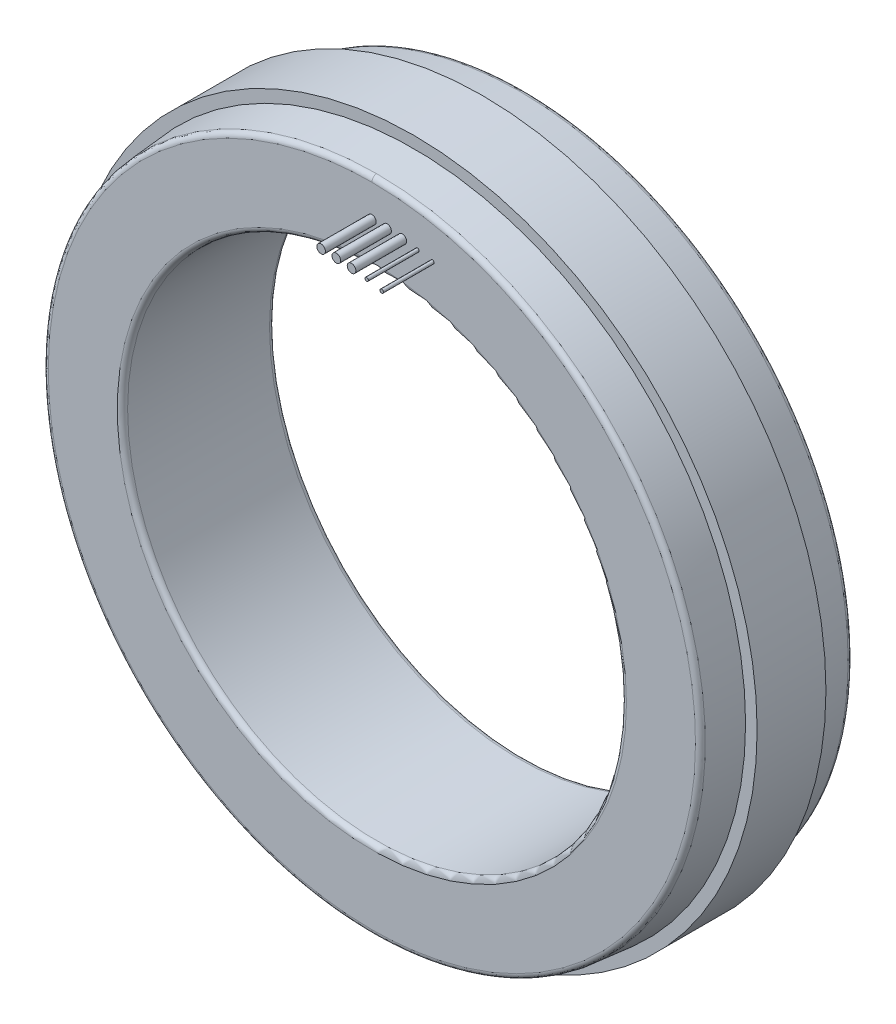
ISO-10303-21;
HEADER;
FILE_DESCRIPTION(('STEP AP214'),'2;1');
FILE_NAME('part.step','',(''),(''),'','','');
FILE_SCHEMA(('AUTOMOTIVE_DESIGN { 1 0 10303 214 1 1 1 1 }'));
ENDSEC;
DATA;
#1=APPLICATION_CONTEXT('core data for automotive mechanical design processes');
#2=APPLICATION_PROTOCOL_DEFINITION('international standard','automotive_design',2000,#1);
#3=PRODUCT_CONTEXT('',#1,'mechanical');
#4=PRODUCT('Part','Part','',(#3));
#5=PRODUCT_RELATED_PRODUCT_CATEGORY('part','',(#4));
#6=PRODUCT_DEFINITION_FORMATION('','',#4);
#7=PRODUCT_DEFINITION_CONTEXT('part definition',#1,'design');
#8=PRODUCT_DEFINITION('design','',#6,#7);
#9=PRODUCT_DEFINITION_SHAPE('','',#8);
#10=(LENGTH_UNIT() NAMED_UNIT(*) SI_UNIT(.MILLI.,.METRE.));
#11=(NAMED_UNIT(*) PLANE_ANGLE_UNIT() SI_UNIT($,.RADIAN.));
#12=(NAMED_UNIT(*) SI_UNIT($,.STERADIAN.) SOLID_ANGLE_UNIT());
#13=UNCERTAINTY_MEASURE_WITH_UNIT(LENGTH_MEASURE(1.E-05),#10,'distance_accuracy_value','');
#14=(GEOMETRIC_REPRESENTATION_CONTEXT(3) GLOBAL_UNCERTAINTY_ASSIGNED_CONTEXT((#13)) GLOBAL_UNIT_ASSIGNED_CONTEXT((#10,
#11,#12)) REPRESENTATION_CONTEXT('',''));
#15=CARTESIAN_POINT('',(0.,0.,0.));
#16=DIRECTION('',(0.,0.,1.));
#17=DIRECTION('',(1.,0.,0.));
#18=AXIS2_PLACEMENT_3D('',#15,#16,#17);
#19=CARTESIAN_POINT('',(102.66993,-102.66993,-22.86));
#20=DIRECTION('',(0.,0.,1.));
#21=DIRECTION('',(0.,1.,0.));
#22=AXIS2_PLACEMENT_3D('',#19,#20,#21);
#23=PLANE('',#22);
#24=CARTESIAN_POINT('',(0.,0.,-22.8600000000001));
#25=DIRECTION('',(0.,0.,1.));
#26=DIRECTION('',(1.,0.,0.));
#27=AXIS2_PLACEMENT_3D('',#24,#25,#26);
#28=CIRCLE('',#27,98.044);
#29=CARTESIAN_POINT('',(98.044,0.,-22.8600000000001));
#30=VERTEX_POINT('',#29);
#31=EDGE_CURVE('E20',#30,#30,#28,.T.);
#32=ORIENTED_EDGE('',*,*,#31,.T.);
#33=EDGE_LOOP('',(#32));
#34=FACE_BOUND('',#33,.T.);
#35=CARTESIAN_POINT('',(0.,0.,-22.86));
#36=DIRECTION('',(0.,0.,1.));
#37=DIRECTION('',(1.,0.,0.));
#38=AXIS2_PLACEMENT_3D('',#35,#36,#37);
#39=CIRCLE('',#38,101.4525);
#40=CARTESIAN_POINT('',(101.4525,0.,-22.86));
#41=VERTEX_POINT('',#40);
#42=EDGE_CURVE('E65',#41,#41,#39,.F.);
#43=ORIENTED_EDGE('',*,*,#42,.T.);
#44=EDGE_LOOP('',(#43));
#45=FACE_BOUND('',#44,.T.);
#46=ADVANCED_FACE('F16',(#34,#45),#23,.F.);
#47=CARTESIAN_POINT('',(0.,0.,-33.787825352));
#48=DIRECTION('',(0.,0.,1.));
#49=DIRECTION('',(1.,0.,0.));
#50=AXIS2_PLACEMENT_3D('',#47,#48,#49);
#51=CONICAL_SURFACE('',#50,97.087939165,0.087266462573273);
#52=ORIENTED_EDGE('',*,*,#31,.F.);
#53=EDGE_LOOP('',(#52));
#54=FACE_BOUND('',#53,.T.);
#55=CARTESIAN_POINT('',(0.,0.,-33.7878253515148));
#56=DIRECTION('',(0.,0.,1.));
#57=DIRECTION('',(1.,0.,0.));
#58=AXIS2_PLACEMENT_3D('',#55,#56,#57);
#59=CIRCLE('',#58,97.0879391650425);
#60=CARTESIAN_POINT('',(0.,97.0879391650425,-33.7878253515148));
#61=VERTEX_POINT('',#60);
#62=CARTESIAN_POINT('',(0.,-97.0879391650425,-33.7878253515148));
#63=VERTEX_POINT('',#62);
#64=EDGE_CURVE('E57',#61,#63,#59,.T.);
#65=ORIENTED_EDGE('',*,*,#64,.T.);
#66=CARTESIAN_POINT('',(0.,0.,-33.7878253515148));
#67=DIRECTION('',(0.,0.,1.));
#68=DIRECTION('',(1.,0.,0.));
#69=AXIS2_PLACEMENT_3D('',#66,#67,#68);
#70=CIRCLE('',#69,97.0879391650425);
#71=EDGE_CURVE('E63',#63,#61,#70,.T.);
#72=ORIENTED_EDGE('',*,*,#71,.T.);
#73=EDGE_LOOP('',(#65,#72));
#74=FACE_BOUND('',#73,.T.);
#75=ADVANCED_FACE('F62',(#54,#74),#51,.T.);
#76=CARTESIAN_POINT('',(0.,0.,-22.86));
#77=DIRECTION('',(0.,0.,1.));
#78=DIRECTION('',(1.,0.,0.));
#79=AXIS2_PLACEMENT_3D('',#76,#77,#78);
#80=CYLINDRICAL_SURFACE('',#79,101.4525);
#81=ORIENTED_EDGE('',*,*,#42,.F.);
#82=EDGE_LOOP('',(#81));
#83=FACE_BOUND('',#82,.T.);
#84=CARTESIAN_POINT('',(0.,0.,-2.54));
#85=DIRECTION('',(0.,0.,1.));
#86=DIRECTION('',(1.,0.,0.));
#87=AXIS2_PLACEMENT_3D('',#84,#85,#86);
#88=CIRCLE('',#87,101.4525);
#89=CARTESIAN_POINT('',(101.4525,0.,-2.54));
#90=VERTEX_POINT('',#89);
#91=EDGE_CURVE('E137',#90,#90,#88,.T.);
#92=ORIENTED_EDGE('',*,*,#91,.F.);
#93=EDGE_LOOP('',(#92));
#94=FACE_BOUND('',#93,.T.);
#95=ADVANCED_FACE('F100',(#83,#94),#80,.T.);
#96=CARTESIAN_POINT('',(0.,-97.0879914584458,-33.7872276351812));
#97=CARTESIAN_POINT('',(-194.175982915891,-97.0879914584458,-33.7872276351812));
#98=CARTESIAN_POINT('',(-194.175982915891,97.0879914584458,-33.7872276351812));
#99=CARTESIAN_POINT('',(0.,97.0879914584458,-33.7872276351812));
#100=CARTESIAN_POINT('',(0.,-97.0879740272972,-33.7874268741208));
#101=CARTESIAN_POINT('',(-194.175948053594,-97.0879740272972,-33.7874268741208));
#102=CARTESIAN_POINT('',(-194.175948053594,97.0879740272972,-33.7874268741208));
#103=CARTESIAN_POINT('',(0.,97.0879740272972,-33.7874268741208));
#104=CARTESIAN_POINT('',(0.,-97.0879565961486,-33.7876261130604));
#105=CARTESIAN_POINT('',(-194.175913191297,-97.0879565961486,-33.7876261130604));
#106=CARTESIAN_POINT('',(-194.175913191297,97.0879565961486,-33.7876261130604));
#107=CARTESIAN_POINT('',(0.,97.0879565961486,-33.7876261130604));
#108=CARTESIAN_POINT('',(0.,-97.087939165,-33.787825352));
#109=CARTESIAN_POINT('',(-194.175878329,-97.087939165,-33.787825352));
#110=CARTESIAN_POINT('',(-194.175878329,97.087939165,-33.787825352));
#111=CARTESIAN_POINT('',(0.,97.087939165,-33.787825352));
#112=CARTESIAN_POINT('',(0.,-97.015412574,-34.616808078));
#113=CARTESIAN_POINT('',(-194.030825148,-97.015412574,-34.616808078));
#114=CARTESIAN_POINT('',(-194.030825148,97.015412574,-34.616808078));
#115=CARTESIAN_POINT('',(0.,97.015412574,-34.616808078));
#116=CARTESIAN_POINT('',(0.,-96.40188775,-35.179));
#117=CARTESIAN_POINT('',(-192.8037755,-96.40188775,-35.179));
#118=CARTESIAN_POINT('',(-192.8037755,96.40188775,-35.179));
#119=CARTESIAN_POINT('',(0.,96.40188775,-35.179));
#120=CARTESIAN_POINT('',(0.,-95.569738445,-35.179));
#121=CARTESIAN_POINT('',(-191.13947689,-95.569738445,-35.179));
#122=CARTESIAN_POINT('',(-191.13947689,95.569738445,-35.179));
#123=CARTESIAN_POINT('',(0.,95.569738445,-35.179));
#124=CARTESIAN_POINT('',(0.,-95.5628724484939,-35.179));
#125=CARTESIAN_POINT('',(-191.125744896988,-95.5628724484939,-35.179));
#126=CARTESIAN_POINT('',(-191.125744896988,95.5628724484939,-35.179));
#127=CARTESIAN_POINT('',(0.,95.5628724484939,-35.179));
#128=CARTESIAN_POINT('',(0.,-95.5560064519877,-35.179));
#129=CARTESIAN_POINT('',(-191.112012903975,-95.5560064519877,-35.179));
#130=CARTESIAN_POINT('',(-191.112012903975,95.5560064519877,-35.179));
#131=CARTESIAN_POINT('',(0.,95.5560064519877,-35.179));
#132=CARTESIAN_POINT('',(0.,-95.5491404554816,-35.179));
#133=CARTESIAN_POINT('',(-191.098280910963,-95.5491404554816,-35.179));
#134=CARTESIAN_POINT('',(-191.098280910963,95.5491404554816,-35.179));
#135=CARTESIAN_POINT('',(0.,95.5491404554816,-35.179));
#136=(BOUNDED_SURFACE() B_SPLINE_SURFACE(3,3,((#96,#97,#98,#99),(#100,#101,#102,#103),(#104,
#105,#106,#107),(#108,#109,#110,#111),(#112,#113,#114,#115),(#116,#117,#118,#119),(#120,#121,
#122,#123),(#124,#125,#126,#127),(#128,#129,#130,#131),(#132,#133,#134,#135)),.UNSPECIFIED.,.F.,
.F.,.F.) B_SPLINE_SURFACE_WITH_KNOTS((4,3,3,4),(4,4),(0.132784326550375,0.132998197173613,
0.867001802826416,0.874343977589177),(0.,1.),
.UNSPECIFIED.) GEOMETRIC_REPRESENTATION_ITEM() RATIONAL_B_SPLINE_SURFACE(((0.898908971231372,
0.299636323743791,0.299636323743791,0.898908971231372),(0.898908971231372,0.299636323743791,
0.299636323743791,0.898908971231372),(0.898908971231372,0.299636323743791,0.299636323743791,
0.898908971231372),(0.898908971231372,0.299636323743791,0.299636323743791,0.898908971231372),
(0.741466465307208,0.247155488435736,0.247155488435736,0.741466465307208),(0.741466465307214,
0.247155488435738,0.247155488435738,0.741466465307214),(0.898908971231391,0.299636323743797,
0.299636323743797,0.898908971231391),(0.898908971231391,0.299636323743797,0.299636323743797,
0.898908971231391),(0.898908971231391,0.299636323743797,0.299636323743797,0.898908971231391),
(0.898908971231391,0.299636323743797,0.299636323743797,0.898908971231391))) REPRESENTATION_ITEM('') SURFACE());
#137=CARTESIAN_POINT('',(0.,97.0879914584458,-33.7872276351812));
#138=CARTESIAN_POINT('',(0.,97.0879740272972,-33.7874268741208));
#139=CARTESIAN_POINT('',(0.,97.0879565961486,-33.7876261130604));
#140=CARTESIAN_POINT('',(0.,97.087939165,-33.787825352));
#141=CARTESIAN_POINT('',(0.,97.015412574,-34.616808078));
#142=CARTESIAN_POINT('',(0.,96.40188775,-35.179));
#143=CARTESIAN_POINT('',(0.,95.569738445,-35.179));
#144=CARTESIAN_POINT('',(0.,95.5628724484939,-35.179));
#145=CARTESIAN_POINT('',(0.,95.5560064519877,-35.179));
#146=CARTESIAN_POINT('',(0.,95.5491404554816,-35.179));
#147=(BOUNDED_CURVE() B_SPLINE_CURVE(3,(#137,#138,#139,#140,#141,#142,#143,#144,#145,#146),
.UNSPECIFIED.,.F.,.F.) B_SPLINE_CURVE_WITH_KNOTS((4,3,3,4),(0.132784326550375,0.132998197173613,
0.867001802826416,0.874343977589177),
.UNSPECIFIED.) CURVE() GEOMETRIC_REPRESENTATION_ITEM() RATIONAL_B_SPLINE_CURVE((0.898908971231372,
0.898908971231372,0.898908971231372,0.898908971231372,0.741466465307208,0.741466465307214,
0.898908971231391,0.898908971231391,0.898908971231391,0.898908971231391)) REPRESENTATION_ITEM(''));
#148=CARTESIAN_POINT('',(0.,95.5697384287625,-35.179));
#149=VERTEX_POINT('',#148);
#150=EDGE_CURVE('E72',#61,#149,#147,.T.);
#151=CARTESIAN_POINT('',(0.,95.5697384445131,-35.179));
#152=CARTESIAN_POINT('',(-191.139476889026,95.569738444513,-35.179));
#153=CARTESIAN_POINT('',(-191.139476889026,-95.569738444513,-35.179));
#154=CARTESIAN_POINT('',(0.,-95.5697384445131,-35.179));
#155=(BOUNDED_CURVE() B_SPLINE_CURVE(3,(#151,#152,#153,#154),.UNSPECIFIED.,.F.,
.F.) B_SPLINE_CURVE_WITH_KNOTS((4,4),(0.,1.),
.UNSPECIFIED.) CURVE() GEOMETRIC_REPRESENTATION_ITEM() RATIONAL_B_SPLINE_CURVE((0.898908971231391,
0.299636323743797,0.299636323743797,0.898908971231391)) REPRESENTATION_ITEM(''));
#156=CARTESIAN_POINT('',(0.,-95.5697384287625,-35.179));
#157=VERTEX_POINT('',#156);
#158=EDGE_CURVE('E78',#149,#157,#155,.T.);
#159=CARTESIAN_POINT('',(0.,-95.5491404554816,-35.179));
#160=CARTESIAN_POINT('',(0.,-95.5560064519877,-35.179));
#161=CARTESIAN_POINT('',(0.,-95.5628724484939,-35.179));
#162=CARTESIAN_POINT('',(0.,-95.569738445,-35.179));
#163=CARTESIAN_POINT('',(0.,-96.40188775,-35.179));
#164=CARTESIAN_POINT('',(0.,-97.015412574,-34.616808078));
#165=CARTESIAN_POINT('',(0.,-97.087939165,-33.787825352));
#166=CARTESIAN_POINT('',(0.,-97.0879565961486,-33.7876261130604));
#167=CARTESIAN_POINT('',(0.,-97.0879740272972,-33.7874268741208));
#168=CARTESIAN_POINT('',(0.,-97.0879914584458,-33.7872276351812));
#169=(BOUNDED_CURVE() B_SPLINE_CURVE(3,(#159,#160,#161,#162,#163,#164,#165,#166,#167,#168),
.UNSPECIFIED.,.F.,.F.) B_SPLINE_CURVE_WITH_KNOTS((4,3,3,4),(0.132784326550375,0.140126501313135,
0.874130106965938,0.874343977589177),
.UNSPECIFIED.) CURVE() GEOMETRIC_REPRESENTATION_ITEM() RATIONAL_B_SPLINE_CURVE((0.898908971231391,
0.898908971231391,0.898908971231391,0.898908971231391,0.741466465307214,0.741466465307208,
0.898908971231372,0.898908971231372,0.898908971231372,0.898908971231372)) REPRESENTATION_ITEM(''));
#170=EDGE_CURVE('E64',#157,#63,#169,.T.);
#171=ORIENTED_EDGE('',*,*,#150,.T.);
#172=ORIENTED_EDGE('',*,*,#158,.T.);
#173=ORIENTED_EDGE('',*,*,#170,.T.);
#174=ORIENTED_EDGE('',*,*,#64,.F.);
#175=EDGE_LOOP('',(#171,#172,#173,#174));
#176=FACE_BOUND('',#175,.T.);
#177=ADVANCED_FACE('F77',(#176),#136,.F.);
#178=CARTESIAN_POINT('',(0.,97.0897343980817,-33.767305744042));
#179=CARTESIAN_POINT('',(194.179468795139,97.0897343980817,-33.767305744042));
#180=CARTESIAN_POINT('',(194.179468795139,-97.0897343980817,-33.767305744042));
#181=CARTESIAN_POINT('',(0.,-97.0897343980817,-33.767305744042));
#182=CARTESIAN_POINT('',(0.,97.0891359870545,-33.7741456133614));
#183=CARTESIAN_POINT('',(194.178271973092,97.0891359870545,-33.7741456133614));
#184=CARTESIAN_POINT('',(194.178271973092,-97.0891359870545,-33.7741456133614));
#185=CARTESIAN_POINT('',(0.,-97.0891359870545,-33.7741456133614));
#186=CARTESIAN_POINT('',(0.,97.0885375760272,-33.7809854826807));
#187=CARTESIAN_POINT('',(194.177075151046,97.0885375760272,-33.7809854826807));
#188=CARTESIAN_POINT('',(194.177075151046,-97.0885375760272,-33.7809854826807));
#189=CARTESIAN_POINT('',(0.,-97.0885375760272,-33.7809854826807));
#190=CARTESIAN_POINT('',(0.,97.087939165,-33.787825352));
#191=CARTESIAN_POINT('',(194.175878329,97.087939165,-33.787825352));
#192=CARTESIAN_POINT('',(194.175878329,-97.087939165,-33.787825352));
#193=CARTESIAN_POINT('',(0.,-97.087939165,-33.787825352));
#194=CARTESIAN_POINT('',(0.,97.015412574,-34.616808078));
#195=CARTESIAN_POINT('',(194.030825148,97.015412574,-34.616808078));
#196=CARTESIAN_POINT('',(194.030825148,-97.015412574,-34.616808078));
#197=CARTESIAN_POINT('',(0.,-97.015412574,-34.616808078));
#198=CARTESIAN_POINT('',(0.,96.40188775,-35.179));
#199=CARTESIAN_POINT('',(192.8037755,96.40188775,-35.179));
#200=CARTESIAN_POINT('',(192.8037755,-96.40188775,-35.179));
#201=CARTESIAN_POINT('',(0.,-96.40188775,-35.179));
#202=CARTESIAN_POINT('',(0.,95.569738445,-35.179));
#203=CARTESIAN_POINT('',(191.13947689,95.569738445,-35.179));
#204=CARTESIAN_POINT('',(191.13947689,-95.569738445,-35.179));
#205=CARTESIAN_POINT('',(0.,-95.569738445,-35.179));
#206=CARTESIAN_POINT('',(0.,95.569538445,-35.179));
#207=CARTESIAN_POINT('',(191.13907689,95.569538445,-35.179));
#208=CARTESIAN_POINT('',(191.13907689,-95.569538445,-35.179));
#209=CARTESIAN_POINT('',(0.,-95.569538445,-35.179));
#210=CARTESIAN_POINT('',(0.,95.569338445,-35.179));
#211=CARTESIAN_POINT('',(191.13867689,95.569338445,-35.179));
#212=CARTESIAN_POINT('',(191.13867689,-95.569338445,-35.179));
#213=CARTESIAN_POINT('',(0.,-95.569338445,-35.179));
#214=CARTESIAN_POINT('',(0.,95.569138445,-35.179));
#215=CARTESIAN_POINT('',(191.13827689,95.569138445,-35.179));
#216=CARTESIAN_POINT('',(191.13827689,-95.569138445,-35.179));
#217=CARTESIAN_POINT('',(0.,-95.569138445,-35.179));
#218=(BOUNDED_SURFACE() B_SPLINE_SURFACE(3,3,((#178,#179,#180,#181),(#182,#183,#184,#185),(#186,
#187,#188,#189),(#190,#191,#192,#193),(#194,#195,#196,#197),(#198,#199,#200,#201),(#202,#203,
#204,#205),(#206,#207,#208,#209),(#210,#211,#212,#213),(#214,#215,#216,#217)),.UNSPECIFIED.,.F.,
.F.,.F.) B_SPLINE_SURFACE_WITH_KNOTS((4,3,3,4),(4,4),(0.125656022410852,0.132998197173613,
0.867001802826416,0.867215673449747),(0.,1.),
.UNSPECIFIED.) GEOMETRIC_REPRESENTATION_ITEM() RATIONAL_B_SPLINE_SURFACE(((0.898908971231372,
0.299636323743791,0.299636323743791,0.898908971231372),(0.898908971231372,0.299636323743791,
0.299636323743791,0.898908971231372),(0.898908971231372,0.299636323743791,0.299636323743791,
0.898908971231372),(0.898908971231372,0.299636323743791,0.299636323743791,0.898908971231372),
(0.741466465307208,0.247155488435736,0.247155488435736,0.741466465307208),(0.741466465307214,
0.247155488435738,0.247155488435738,0.741466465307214),(0.898908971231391,0.299636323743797,
0.299636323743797,0.898908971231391),(0.898908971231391,0.299636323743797,0.299636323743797,
0.898908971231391),(0.898908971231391,0.299636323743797,0.299636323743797,0.898908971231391),
(0.898908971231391,0.299636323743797,0.299636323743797,0.898908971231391))) REPRESENTATION_ITEM('') SURFACE());
#219=CARTESIAN_POINT('',(0.,-95.569738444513,-35.179));
#220=CARTESIAN_POINT('',(191.139476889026,-95.569738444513,-35.179));
#221=CARTESIAN_POINT('',(191.139476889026,95.569738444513,-35.179));
#222=CARTESIAN_POINT('',(0.,95.569738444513,-35.179));
#223=(BOUNDED_CURVE() B_SPLINE_CURVE(3,(#219,#220,#221,#222),.UNSPECIFIED.,.F.,
.F.) B_SPLINE_CURVE_WITH_KNOTS((4,4),(0.,1.),
.UNSPECIFIED.) CURVE() GEOMETRIC_REPRESENTATION_ITEM() RATIONAL_B_SPLINE_CURVE((0.898908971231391,
0.299636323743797,0.299636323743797,0.898908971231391)) REPRESENTATION_ITEM(''));
#224=EDGE_CURVE('E138',#157,#149,#223,.T.);
#225=ORIENTED_EDGE('',*,*,#71,.F.);
#226=ORIENTED_EDGE('',*,*,#170,.F.);
#227=ORIENTED_EDGE('',*,*,#224,.T.);
#228=ORIENTED_EDGE('',*,*,#150,.F.);
#229=EDGE_LOOP('',(#225,#226,#227,#228));
#230=FACE_BOUND('',#229,.T.);
#231=ADVANCED_FACE('F68',(#230),#218,.F.);
#232=CARTESIAN_POINT('',(102.66993,-102.66993,-2.54));
#233=DIRECTION('',(0.,0.,1.));
#234=DIRECTION('',(0.,1.,0.));
#235=AXIS2_PLACEMENT_3D('',#232,#233,#234);
#236=PLANE('',#235);
#237=CARTESIAN_POINT('',(0.,0.,-2.53999999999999));
#238=DIRECTION('',(0.,0.,-1.));
#239=DIRECTION('',(-1.,0.,0.));
#240=AXIS2_PLACEMENT_3D('',#237,#238,#239);
#241=CIRCLE('',#240,98.044);
#242=CARTESIAN_POINT('',(-98.044,0.,-2.53999999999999));
#243=VERTEX_POINT('',#242);
#244=EDGE_CURVE('E142',#243,#243,#241,.T.);
#245=ORIENTED_EDGE('',*,*,#244,.T.);
#246=EDGE_LOOP('',(#245));
#247=FACE_BOUND('',#246,.T.);
#248=ORIENTED_EDGE('',*,*,#91,.T.);
#249=EDGE_LOOP('',(#248));
#250=FACE_BOUND('',#249,.T.);
#251=ADVANCED_FACE('F379',(#247,#250),#236,.T.);
#252=CARTESIAN_POINT('',(-96.716588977,96.716575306,-35.179));
#253=DIRECTION('',(0.,0.,1.));
#254=DIRECTION('',(0.,-1.,0.));
#255=AXIS2_PLACEMENT_3D('',#252,#253,#254);
#256=PLANE('',#255);
#257=CARTESIAN_POINT('',(0.,0.,-35.179));
#258=DIRECTION('',(0.,0.,-1.));
#259=DIRECTION('',(-1.,0.,0.));
#260=AXIS2_PLACEMENT_3D('',#257,#258,#259);
#261=CIRCLE('',#260,75.1839999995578);
#262=CARTESIAN_POINT('',(-75.1839999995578,0.,-35.179));
#263=VERTEX_POINT('',#262);
#264=EDGE_CURVE('E203',#263,#263,#261,.F.);
#265=ORIENTED_EDGE('',*,*,#264,.T.);
#266=EDGE_LOOP('',(#265));
#267=FACE_BOUND('',#266,.T.);
#268=ORIENTED_EDGE('',*,*,#158,.F.);
#269=ORIENTED_EDGE('',*,*,#224,.F.);
#270=EDGE_LOOP('',(#268,#269));
#271=FACE_BOUND('',#270,.T.);
#272=ADVANCED_FACE('F370',(#267,#271),#256,.F.);
#273=CARTESIAN_POINT('',(0.,0.,8.387825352));
#274=DIRECTION('',(0.,0.,-1.));
#275=DIRECTION('',(-1.,0.,0.));
#276=AXIS2_PLACEMENT_3D('',#273,#274,#275);
#277=CONICAL_SURFACE('',#276,97.087939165,0.087266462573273);
#278=ORIENTED_EDGE('',*,*,#244,.F.);
#279=EDGE_LOOP('',(#278));
#280=FACE_BOUND('',#279,.T.);
#281=CARTESIAN_POINT('',(0.,0.,8.38782535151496));
#282=DIRECTION('',(0.,0.,-1.));
#283=DIRECTION('',(-1.,0.,0.));
#284=AXIS2_PLACEMENT_3D('',#281,#282,#283);
#285=CIRCLE('',#284,97.0879391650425);
#286=CARTESIAN_POINT('',(2.48913216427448E-09,97.0879391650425,8.38782535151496));
#287=VERTEX_POINT('',#286);
#288=CARTESIAN_POINT('',(0.,-97.0879391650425,8.38782535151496));
#289=VERTEX_POINT('',#288);
#290=EDGE_CURVE('E218',#287,#289,#285,.T.);
#291=ORIENTED_EDGE('',*,*,#290,.T.);
#292=CARTESIAN_POINT('',(0.,0.,8.38782535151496));
#293=DIRECTION('',(0.,0.,-1.));
#294=DIRECTION('',(-1.,0.,0.));
#295=AXIS2_PLACEMENT_3D('',#292,#293,#294);
#296=CIRCLE('',#295,97.0879391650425);
#297=EDGE_CURVE('E195',#289,#287,#296,.T.);
#298=ORIENTED_EDGE('',*,*,#297,.T.);
#299=EDGE_LOOP('',(#291,#298));
#300=FACE_BOUND('',#299,.T.);
#301=ADVANCED_FACE('F175',(#280,#300),#277,.T.);
#302=CARTESIAN_POINT('',(12.945916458,84.469078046,24.779));
#303=DIRECTION('',(0.,0.,1.));
#304=DIRECTION('',(1.,0.,0.));
#305=AXIS2_PLACEMENT_3D('',#302,#303,#304);
#306=PLANE('',#305);
#307=CARTESIAN_POINT('',(13.460012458,84.983174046,24.779));
#308=DIRECTION('',(0.,0.,-1.));
#309=DIRECTION('',(0.,1.,0.));
#310=AXIS2_PLACEMENT_3D('',#307,#308,#309);
#311=CIRCLE('',#310,0.507999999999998);
#312=CARTESIAN_POINT('',(13.460012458,85.491174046,24.779));
#313=VERTEX_POINT('',#312);
#314=EDGE_CURVE('E222',#313,#313,#311,.F.);
#315=ORIENTED_EDGE('',*,*,#314,.T.);
#316=EDGE_LOOP('',(#315));
#317=FACE_BOUND('',#316,.T.);
#318=ADVANCED_FACE('F346',(#317),#306,.T.);
#319=CARTESIAN_POINT('',(3.217876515,84.639341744,24.779));
#320=DIRECTION('',(0.,0.,1.));
#321=DIRECTION('',(1.,0.,0.));
#322=AXIS2_PLACEMENT_3D('',#319,#320,#321);
#323=PLANE('',#322);
#324=CARTESIAN_POINT('',(4.503116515,85.924581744,24.779));
#325=DIRECTION('',(0.,0.,-1.));
#326=DIRECTION('',(0.,1.,0.));
#327=AXIS2_PLACEMENT_3D('',#324,#325,#326);
#328=CIRCLE('',#327,1.27);
#329=CARTESIAN_POINT('',(4.503116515,87.194581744,24.779));
#330=VERTEX_POINT('',#329);
#331=EDGE_CURVE('E226',#330,#330,#328,.F.);
#332=ORIENTED_EDGE('',*,*,#331,.T.);
#333=EDGE_LOOP('',(#332));
#334=FACE_BOUND('',#333,.T.);
#335=ADVANCED_FACE('F337',(#334),#323,.T.);
#336=CARTESIAN_POINT('',(-1.28524,84.75726,24.779));
#337=DIRECTION('',(0.,0.,1.));
#338=DIRECTION('',(1.,0.,0.));
#339=AXIS2_PLACEMENT_3D('',#336,#337,#338);
#340=PLANE('',#339);
#341=CARTESIAN_POINT('',(0.,86.0425,24.779));
#342=DIRECTION('',(0.,0.,-1.));
#343=DIRECTION('',(0.,1.,0.));
#344=AXIS2_PLACEMENT_3D('',#341,#342,#343);
#345=CIRCLE('',#344,1.27);
#346=CARTESIAN_POINT('',(0.,87.3125,24.779));
#347=VERTEX_POINT('',#346);
#348=EDGE_CURVE('E249',#347,#347,#345,.F.);
#349=ORIENTED_EDGE('',*,*,#348,.T.);
#350=EDGE_LOOP('',(#349));
#351=FACE_BOUND('',#350,.T.);
#352=ADVANCED_FACE('F334',(#351),#340,.T.);
#353=CARTESIAN_POINT('',(7.708650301,84.285910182,24.779));
#354=DIRECTION('',(0.,0.,1.));
#355=DIRECTION('',(1.,0.,0.));
#356=AXIS2_PLACEMENT_3D('',#353,#354,#355);
#357=PLANE('',#356);
#358=CARTESIAN_POINT('',(8.993890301,85.571150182,24.779));
#359=DIRECTION('',(0.,0.,-1.));
#360=DIRECTION('',(0.,1.,0.));
#361=AXIS2_PLACEMENT_3D('',#358,#359,#360);
#362=CIRCLE('',#361,1.27);
#363=CARTESIAN_POINT('',(8.993890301,86.841150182,24.779));
#364=VERTEX_POINT('',#363);
#365=EDGE_CURVE('E244',#364,#364,#362,.F.);
#366=ORIENTED_EDGE('',*,*,#365,.T.);
#367=EDGE_LOOP('',(#366));
#368=FACE_BOUND('',#367,.T.);
#369=ADVANCED_FACE('F336',(#368),#357,.T.);
#370=CARTESIAN_POINT('',(17.375145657,83.648168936,24.779));
#371=DIRECTION('',(0.,0.,1.));
#372=DIRECTION('',(1.,0.,0.));
#373=AXIS2_PLACEMENT_3D('',#370,#371,#372);
#374=PLANE('',#373);
#375=CARTESIAN_POINT('',(17.889241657,84.162264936,24.779));
#376=DIRECTION('',(0.,0.,-1.));
#377=DIRECTION('',(0.,1.,0.));
#378=AXIS2_PLACEMENT_3D('',#375,#376,#377);
#379=CIRCLE('',#378,0.507999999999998);
#380=CARTESIAN_POINT('',(17.889241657,84.670264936,24.779));
#381=VERTEX_POINT('',#380);
#382=EDGE_CURVE('E240',#381,#381,#379,.F.);
#383=ORIENTED_EDGE('',*,*,#382,.T.);
#384=EDGE_LOOP('',(#383));
#385=FACE_BOUND('',#384,.T.);
#386=ADVANCED_FACE('F343',(#385),#374,.T.);
#387=CARTESIAN_POINT('',(0.,0.,-33.655));
#388=DIRECTION('',(0.,0.,-1.));
#389=DIRECTION('',(-1.,0.,0.));
#390=AXIS2_PLACEMENT_3D('',#387,#388,#389);
#391=TOROIDAL_SURFACE('',#390,75.184,1.524);
#392=ORIENTED_EDGE('',*,*,#264,.F.);
#393=EDGE_LOOP('',(#392));
#394=FACE_BOUND('',#393,.T.);
#395=CARTESIAN_POINT('',(0.,0.,-33.655));
#396=DIRECTION('',(0.,0.,-1.));
#397=DIRECTION('',(-1.,0.,0.));
#398=AXIS2_PLACEMENT_3D('',#395,#396,#397);
#399=CIRCLE('',#398,73.66);
#400=CARTESIAN_POINT('',(-73.66,0.,-33.655));
#401=VERTEX_POINT('',#400);
#402=EDGE_CURVE('E238',#401,#401,#399,.T.);
#403=ORIENTED_EDGE('',*,*,#402,.F.);
#404=EDGE_LOOP('',(#403));
#405=FACE_BOUND('',#404,.T.);
#406=ADVANCED_FACE('F169',(#394,#405),#391,.T.);
#407=CARTESIAN_POINT('',(0.,97.0897343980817,8.36730574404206));
#408=CARTESIAN_POINT('',(-194.179468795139,97.0897343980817,8.36730574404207));
#409=CARTESIAN_POINT('',(-194.179468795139,-97.0897343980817,8.36730574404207));
#410=CARTESIAN_POINT('',(0.,-97.0897343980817,8.36730574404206));
#411=CARTESIAN_POINT('',(0.,97.0891359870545,8.37414561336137));
#412=CARTESIAN_POINT('',(-194.178271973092,97.0891359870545,8.37414561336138));
#413=CARTESIAN_POINT('',(-194.178271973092,-97.0891359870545,8.37414561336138));
#414=CARTESIAN_POINT('',(0.,-97.0891359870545,8.37414561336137));
#415=CARTESIAN_POINT('',(0.,97.0885375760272,8.38098548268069));
#416=CARTESIAN_POINT('',(-194.177075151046,97.0885375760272,8.38098548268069));
#417=CARTESIAN_POINT('',(-194.177075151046,-97.0885375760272,8.38098548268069));
#418=CARTESIAN_POINT('',(0.,-97.0885375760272,8.38098548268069));
#419=CARTESIAN_POINT('',(0.,97.087939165,8.387825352));
#420=CARTESIAN_POINT('',(-194.175878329,97.087939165,8.387825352));
#421=CARTESIAN_POINT('',(-194.175878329,-97.087939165,8.387825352));
#422=CARTESIAN_POINT('',(0.,-97.087939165,8.387825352));
#423=CARTESIAN_POINT('',(0.,97.015412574,9.216808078));
#424=CARTESIAN_POINT('',(-194.030825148,97.015412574,9.216808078));
#425=CARTESIAN_POINT('',(-194.030825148,-97.015412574,9.216808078));
#426=CARTESIAN_POINT('',(0.,-97.015412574,9.216808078));
#427=CARTESIAN_POINT('',(0.,96.40188775,9.779));
#428=CARTESIAN_POINT('',(-192.8037755,96.40188775,9.779));
#429=CARTESIAN_POINT('',(-192.8037755,-96.40188775,9.779));
#430=CARTESIAN_POINT('',(0.,-96.40188775,9.779));
#431=CARTESIAN_POINT('',(0.,95.569738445,9.779));
#432=CARTESIAN_POINT('',(-191.13947689,95.569738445,9.779));
#433=CARTESIAN_POINT('',(-191.13947689,-95.569738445,9.779));
#434=CARTESIAN_POINT('',(0.,-95.569738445,9.779));
#435=CARTESIAN_POINT('',(0.,95.569538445,9.779));
#436=CARTESIAN_POINT('',(-191.13907689,95.569538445,9.779));
#437=CARTESIAN_POINT('',(-191.13907689,-95.569538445,9.779));
#438=CARTESIAN_POINT('',(0.,-95.569538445,9.779));
#439=CARTESIAN_POINT('',(0.,95.569338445,9.779));
#440=CARTESIAN_POINT('',(-191.13867689,95.569338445,9.779));
#441=CARTESIAN_POINT('',(-191.13867689,-95.569338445,9.779));
#442=CARTESIAN_POINT('',(0.,-95.569338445,9.779));
#443=CARTESIAN_POINT('',(0.,95.569138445,9.779));
#444=CARTESIAN_POINT('',(-191.13827689,95.569138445,9.779));
#445=CARTESIAN_POINT('',(-191.13827689,-95.569138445,9.779));
#446=CARTESIAN_POINT('',(0.,-95.569138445,9.779));
#447=(BOUNDED_SURFACE() B_SPLINE_SURFACE(3,3,((#407,#408,#409,#410),(#411,#412,#413,#414),(#415,
#416,#417,#418),(#419,#420,#421,#422),(#423,#424,#425,#426),(#427,#428,#429,#430),(#431,#432,
#433,#434),(#435,#436,#437,#438),(#439,#440,#441,#442),(#443,#444,#445,#446)),.UNSPECIFIED.,.F.,
.F.,.F.) B_SPLINE_SURFACE_WITH_KNOTS((4,3,3,4),(4,4),(0.125656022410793,0.132998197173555,
0.867001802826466,0.867215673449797),(0.,1.),
.UNSPECIFIED.) GEOMETRIC_REPRESENTATION_ITEM() RATIONAL_B_SPLINE_SURFACE(((0.89890897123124,
0.299636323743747,0.299636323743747,0.89890897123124),(0.89890897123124,0.299636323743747,
0.299636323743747,0.89890897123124),(0.89890897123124,0.299636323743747,0.299636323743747,
0.89890897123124),(0.89890897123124,0.299636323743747,0.299636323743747,0.89890897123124),
(0.741466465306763,0.247155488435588,0.247155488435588,0.741466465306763),(0.741466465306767,
0.247155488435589,0.247155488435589,0.741466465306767),(0.898908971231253,0.299636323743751,
0.299636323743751,0.898908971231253),(0.898908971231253,0.299636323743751,0.299636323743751,
0.898908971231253),(0.898908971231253,0.299636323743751,0.299636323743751,0.898908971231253),
(0.898908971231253,0.299636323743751,0.299636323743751,0.898908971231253))) REPRESENTATION_ITEM('') SURFACE());
#448=CARTESIAN_POINT('',(0.,-97.0897343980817,8.36730574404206));
#449=CARTESIAN_POINT('',(0.,-97.0891359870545,8.37414561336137));
#450=CARTESIAN_POINT('',(0.,-97.0885375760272,8.38098548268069));
#451=CARTESIAN_POINT('',(0.,-97.087939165,8.387825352));
#452=CARTESIAN_POINT('',(0.,-97.015412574,9.216808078));
#453=CARTESIAN_POINT('',(0.,-96.40188775,9.779));
#454=CARTESIAN_POINT('',(0.,-95.569738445,9.779));
#455=CARTESIAN_POINT('',(0.,-95.569538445,9.779));
#456=CARTESIAN_POINT('',(0.,-95.569338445,9.779));
#457=CARTESIAN_POINT('',(0.,-95.569138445,9.779));
#458=(BOUNDED_CURVE() B_SPLINE_CURVE(3,(#448,#449,#450,#451,#452,#453,#454,#455,#456,#457),
.UNSPECIFIED.,.F.,.F.) B_SPLINE_CURVE_WITH_KNOTS((4,3,3,4),(0.125656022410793,0.132998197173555,
0.867001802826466,0.867215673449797),
.UNSPECIFIED.) CURVE() GEOMETRIC_REPRESENTATION_ITEM() RATIONAL_B_SPLINE_CURVE((0.89890897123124,
0.89890897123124,0.89890897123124,0.89890897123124,0.741466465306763,0.741466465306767,
0.898908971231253,0.898908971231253,0.898908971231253,0.898908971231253)) REPRESENTATION_ITEM(''));
#459=CARTESIAN_POINT('',(0.,-95.5697384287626,9.779));
#460=VERTEX_POINT('',#459);
#461=EDGE_CURVE('E202',#289,#460,#458,.T.);
#462=CARTESIAN_POINT('',(0.,-95.5697384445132,9.779));
#463=CARTESIAN_POINT('',(-191.139476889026,-95.5697384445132,9.779));
#464=CARTESIAN_POINT('',(-191.139476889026,95.5697384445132,9.779));
#465=CARTESIAN_POINT('',(0.,95.5697384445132,9.779));
#466=(BOUNDED_CURVE() B_SPLINE_CURVE(3,(#462,#463,#464,#465),.UNSPECIFIED.,.F.,
.F.) B_SPLINE_CURVE_WITH_KNOTS((4,4),(0.,1.),
.UNSPECIFIED.) CURVE() GEOMETRIC_REPRESENTATION_ITEM() RATIONAL_B_SPLINE_CURVE((0.898908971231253,
0.299636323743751,0.299636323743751,0.898908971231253)) REPRESENTATION_ITEM(''));
#467=CARTESIAN_POINT('',(0.,95.5697384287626,9.779));
#468=VERTEX_POINT('',#467);
#469=EDGE_CURVE('E34',#468,#460,#466,.F.);
#470=CARTESIAN_POINT('',(0.,95.569138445,9.779));
#471=CARTESIAN_POINT('',(0.,95.569338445,9.779));
#472=CARTESIAN_POINT('',(0.,95.569538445,9.779));
#473=CARTESIAN_POINT('',(0.,95.569738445,9.779));
#474=CARTESIAN_POINT('',(0.,96.40188775,9.779));
#475=CARTESIAN_POINT('',(0.,97.015412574,9.216808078));
#476=CARTESIAN_POINT('',(0.,97.087939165,8.387825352));
#477=CARTESIAN_POINT('',(0.,97.0885375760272,8.38098548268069));
#478=CARTESIAN_POINT('',(0.,97.0891359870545,8.37414561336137));
#479=CARTESIAN_POINT('',(0.,97.0897343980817,8.36730574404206));
#480=(BOUNDED_CURVE() B_SPLINE_CURVE(3,(#470,#471,#472,#473,#474,#475,#476,#477,#478,#479),
.UNSPECIFIED.,.F.,.F.) B_SPLINE_CURVE_WITH_KNOTS((4,3,3,4),(0.125656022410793,0.125869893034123,
0.859873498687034,0.867215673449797),
.UNSPECIFIED.) CURVE() GEOMETRIC_REPRESENTATION_ITEM() RATIONAL_B_SPLINE_CURVE((0.898908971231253,
0.898908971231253,0.898908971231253,0.898908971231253,0.741466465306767,0.741466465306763,
0.89890897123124,0.89890897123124,0.89890897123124,0.89890897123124)) REPRESENTATION_ITEM(''));
#481=EDGE_CURVE('E221',#468,#287,#480,.T.);
#482=ORIENTED_EDGE('',*,*,#297,.F.);
#483=ORIENTED_EDGE('',*,*,#461,.T.);
#484=ORIENTED_EDGE('',*,*,#469,.F.);
#485=ORIENTED_EDGE('',*,*,#481,.T.);
#486=EDGE_LOOP('',(#482,#483,#484,#485));
#487=FACE_BOUND('',#486,.T.);
#488=ADVANCED_FACE('F157',(#487),#447,.F.);
#489=CARTESIAN_POINT('',(0.,-97.0879914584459,8.38722763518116));
#490=CARTESIAN_POINT('',(194.175982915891,-97.0879914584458,8.38722763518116));
#491=CARTESIAN_POINT('',(194.175982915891,97.0879914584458,8.38722763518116));
#492=CARTESIAN_POINT('',(0.,97.0879914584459,8.38722763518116));
#493=CARTESIAN_POINT('',(0.,-97.0879740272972,8.38742687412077));
#494=CARTESIAN_POINT('',(194.175948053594,-97.0879740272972,8.38742687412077));
#495=CARTESIAN_POINT('',(194.175948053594,97.0879740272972,8.38742687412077));
#496=CARTESIAN_POINT('',(0.,97.0879740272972,8.38742687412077));
#497=CARTESIAN_POINT('',(0.,-97.0879565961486,8.38762611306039));
#498=CARTESIAN_POINT('',(194.175913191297,-97.0879565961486,8.38762611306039));
#499=CARTESIAN_POINT('',(194.175913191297,97.0879565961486,8.38762611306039));
#500=CARTESIAN_POINT('',(0.,97.0879565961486,8.38762611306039));
#501=CARTESIAN_POINT('',(0.,-97.087939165,8.387825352));
#502=CARTESIAN_POINT('',(194.175878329,-97.087939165,8.387825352));
#503=CARTESIAN_POINT('',(194.175878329,97.087939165,8.387825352));
#504=CARTESIAN_POINT('',(0.,97.087939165,8.387825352));
#505=CARTESIAN_POINT('',(0.,-97.015412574,9.216808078));
#506=CARTESIAN_POINT('',(194.030825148,-97.015412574,9.216808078));
#507=CARTESIAN_POINT('',(194.030825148,97.015412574,9.216808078));
#508=CARTESIAN_POINT('',(0.,97.015412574,9.216808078));
#509=CARTESIAN_POINT('',(0.,-96.40188775,9.779));
#510=CARTESIAN_POINT('',(192.8037755,-96.40188775,9.779));
#511=CARTESIAN_POINT('',(192.8037755,96.40188775,9.779));
#512=CARTESIAN_POINT('',(0.,96.40188775,9.779));
#513=CARTESIAN_POINT('',(0.,-95.569738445,9.779));
#514=CARTESIAN_POINT('',(191.13947689,-95.569738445,9.779));
#515=CARTESIAN_POINT('',(191.13947689,95.569738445,9.779));
#516=CARTESIAN_POINT('',(0.,95.569738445,9.779));
#517=CARTESIAN_POINT('',(0.,-95.5628724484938,9.779));
#518=CARTESIAN_POINT('',(191.125744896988,-95.5628724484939,9.779));
#519=CARTESIAN_POINT('',(191.125744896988,95.5628724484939,9.779));
#520=CARTESIAN_POINT('',(0.,95.5628724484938,9.779));
#521=CARTESIAN_POINT('',(0.,-95.5560064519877,9.779));
#522=CARTESIAN_POINT('',(191.112012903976,-95.5560064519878,9.779));
#523=CARTESIAN_POINT('',(191.112012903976,95.5560064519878,9.779));
#524=CARTESIAN_POINT('',(0.,95.5560064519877,9.779));
#525=CARTESIAN_POINT('',(0.,-95.5491404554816,9.779));
#526=CARTESIAN_POINT('',(191.098280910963,-95.5491404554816,9.779));
#527=CARTESIAN_POINT('',(191.098280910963,95.5491404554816,9.779));
#528=CARTESIAN_POINT('',(0.,95.5491404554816,9.779));
#529=(BOUNDED_SURFACE() B_SPLINE_SURFACE(3,3,((#489,#490,#491,#492),(#493,#494,#495,#496),(#497,
#498,#499,#500),(#501,#502,#503,#504),(#505,#506,#507,#508),(#509,#510,#511,#512),(#513,#514,
#515,#516),(#517,#518,#519,#520),(#521,#522,#523,#524),(#525,#526,#527,#528)),.UNSPECIFIED.,.F.,
.F.,.F.) B_SPLINE_SURFACE_WITH_KNOTS((4,3,3,4),(4,4),(0.132784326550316,0.132998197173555,
0.867001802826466,0.874343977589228),(0.,1.),
.UNSPECIFIED.) GEOMETRIC_REPRESENTATION_ITEM() RATIONAL_B_SPLINE_SURFACE(((0.89890897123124,
0.299636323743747,0.299636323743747,0.89890897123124),(0.89890897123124,0.299636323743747,
0.299636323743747,0.89890897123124),(0.89890897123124,0.299636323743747,0.299636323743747,
0.89890897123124),(0.89890897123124,0.299636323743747,0.299636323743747,0.89890897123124),
(0.741466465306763,0.247155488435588,0.247155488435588,0.741466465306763),(0.741466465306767,
0.247155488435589,0.247155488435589,0.741466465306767),(0.898908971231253,0.299636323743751,
0.299636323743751,0.898908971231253),(0.898908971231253,0.299636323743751,0.299636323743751,
0.898908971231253),(0.898908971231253,0.299636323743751,0.299636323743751,0.898908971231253),
(0.898908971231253,0.299636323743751,0.299636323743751,0.898908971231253))) REPRESENTATION_ITEM('') SURFACE());
#530=CARTESIAN_POINT('',(0.,95.5697384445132,9.779));
#531=CARTESIAN_POINT('',(191.139476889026,95.5697384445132,9.779));
#532=CARTESIAN_POINT('',(191.139476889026,-95.5697384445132,9.779));
#533=CARTESIAN_POINT('',(0.,-95.5697384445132,9.779));
#534=(BOUNDED_CURVE() B_SPLINE_CURVE(3,(#530,#531,#532,#533),.UNSPECIFIED.,.F.,
.F.) B_SPLINE_CURVE_WITH_KNOTS((4,4),(0.,1.),
.UNSPECIFIED.) CURVE() GEOMETRIC_REPRESENTATION_ITEM() RATIONAL_B_SPLINE_CURVE((0.898908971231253,
0.299636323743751,0.299636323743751,0.898908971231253)) REPRESENTATION_ITEM(''));
#535=EDGE_CURVE('E219',#460,#468,#534,.F.);
#536=ORIENTED_EDGE('',*,*,#481,.F.);
#537=ORIENTED_EDGE('',*,*,#535,.F.);
#538=ORIENTED_EDGE('',*,*,#461,.F.);
#539=ORIENTED_EDGE('',*,*,#290,.F.);
#540=EDGE_LOOP('',(#536,#537,#538,#539));
#541=FACE_BOUND('',#540,.T.);
#542=ADVANCED_FACE('F168',(#541),#529,.F.);
#543=CARTESIAN_POINT('',(13.460012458,84.983174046,24.779));
#544=DIRECTION('',(0.,0.,-1.));
#545=DIRECTION('',(0.,1.,0.));
#546=AXIS2_PLACEMENT_3D('',#543,#544,#545);
#547=CYLINDRICAL_SURFACE('',#546,0.507999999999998);
#548=CARTESIAN_POINT('',(13.460012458,84.9831740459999,9.779));
#549=DIRECTION('',(0.,0.,-1.));
#550=DIRECTION('',(0.,1.,0.));
#551=AXIS2_PLACEMENT_3D('',#548,#549,#550);
#552=CIRCLE('',#551,0.507999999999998);
#553=CARTESIAN_POINT('',(13.460012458,85.4911740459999,9.779));
#554=VERTEX_POINT('',#553);
#555=EDGE_CURVE('E252',#554,#554,#552,.T.);
#556=ORIENTED_EDGE('',*,*,#555,.F.);
#557=EDGE_LOOP('',(#556));
#558=FACE_BOUND('',#557,.T.);
#559=ORIENTED_EDGE('',*,*,#314,.F.);
#560=EDGE_LOOP('',(#559));
#561=FACE_BOUND('',#560,.T.);
#562=ADVANCED_FACE('F397',(#558,#561),#547,.T.);
#563=CARTESIAN_POINT('',(4.503116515,85.924581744,24.779));
#564=DIRECTION('',(0.,0.,-1.));
#565=DIRECTION('',(0.,1.,0.));
#566=AXIS2_PLACEMENT_3D('',#563,#564,#565);
#567=CYLINDRICAL_SURFACE('',#566,1.27);
#568=CARTESIAN_POINT('',(4.503116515,85.924581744,9.779));
#569=DIRECTION('',(0.,0.,-1.));
#570=DIRECTION('',(0.,1.,0.));
#571=AXIS2_PLACEMENT_3D('',#568,#569,#570);
#572=CIRCLE('',#571,1.27);
#573=CARTESIAN_POINT('',(4.503116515,87.194581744,9.779));
#574=VERTEX_POINT('',#573);
#575=EDGE_CURVE('E296',#574,#574,#572,.T.);
#576=ORIENTED_EDGE('',*,*,#575,.F.);
#577=EDGE_LOOP('',(#576));
#578=FACE_BOUND('',#577,.T.);
#579=ORIENTED_EDGE('',*,*,#331,.F.);
#580=EDGE_LOOP('',(#579));
#581=FACE_BOUND('',#580,.T.);
#582=ADVANCED_FACE('F330',(#578,#581),#567,.T.);
#583=CARTESIAN_POINT('',(0.,86.0425,24.779));
#584=DIRECTION('',(0.,0.,-1.));
#585=DIRECTION('',(0.,1.,0.));
#586=AXIS2_PLACEMENT_3D('',#583,#584,#585);
#587=CYLINDRICAL_SURFACE('',#586,1.27);
#588=CARTESIAN_POINT('',(0.,86.0425,9.779));
#589=DIRECTION('',(0.,0.,-1.));
#590=DIRECTION('',(0.,1.,0.));
#591=AXIS2_PLACEMENT_3D('',#588,#589,#590);
#592=CIRCLE('',#591,1.27);
#593=CARTESIAN_POINT('',(0.,87.3125,9.779));
#594=VERTEX_POINT('',#593);
#595=EDGE_CURVE('E300',#594,#594,#592,.T.);
#596=ORIENTED_EDGE('',*,*,#595,.F.);
#597=EDGE_LOOP('',(#596));
#598=FACE_BOUND('',#597,.T.);
#599=ORIENTED_EDGE('',*,*,#348,.F.);
#600=EDGE_LOOP('',(#599));
#601=FACE_BOUND('',#600,.T.);
#602=ADVANCED_FACE('F326',(#598,#601),#587,.T.);
#603=CARTESIAN_POINT('',(8.993890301,85.571150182,24.779));
#604=DIRECTION('',(0.,0.,-1.));
#605=DIRECTION('',(0.,1.,0.));
#606=AXIS2_PLACEMENT_3D('',#603,#604,#605);
#607=CYLINDRICAL_SURFACE('',#606,1.27);
#608=CARTESIAN_POINT('',(8.993890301,85.571150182,9.779));
#609=DIRECTION('',(0.,0.,-1.));
#610=DIRECTION('',(0.,1.,0.));
#611=AXIS2_PLACEMENT_3D('',#608,#609,#610);
#612=CIRCLE('',#611,1.27);
#613=CARTESIAN_POINT('',(8.993890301,86.841150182,9.779));
#614=VERTEX_POINT('',#613);
#615=EDGE_CURVE('E316',#614,#614,#612,.T.);
#616=ORIENTED_EDGE('',*,*,#615,.F.);
#617=EDGE_LOOP('',(#616));
#618=FACE_BOUND('',#617,.T.);
#619=ORIENTED_EDGE('',*,*,#365,.F.);
#620=EDGE_LOOP('',(#619));
#621=FACE_BOUND('',#620,.T.);
#622=ADVANCED_FACE('F329',(#618,#621),#607,.T.);
#623=CARTESIAN_POINT('',(17.889241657,84.162264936,24.779));
#624=DIRECTION('',(0.,0.,-1.));
#625=DIRECTION('',(0.,1.,0.));
#626=AXIS2_PLACEMENT_3D('',#623,#624,#625);
#627=CYLINDRICAL_SURFACE('',#626,0.507999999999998);
#628=CARTESIAN_POINT('',(17.889241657,84.1622649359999,9.779));
#629=DIRECTION('',(0.,0.,-1.));
#630=DIRECTION('',(0.,1.,0.));
#631=AXIS2_PLACEMENT_3D('',#628,#629,#630);
#632=CIRCLE('',#631,0.507999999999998);
#633=CARTESIAN_POINT('',(17.889241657,84.6702649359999,9.779));
#634=VERTEX_POINT('',#633);
#635=EDGE_CURVE('E313',#634,#634,#632,.T.);
#636=ORIENTED_EDGE('',*,*,#635,.F.);
#637=EDGE_LOOP('',(#636));
#638=FACE_BOUND('',#637,.T.);
#639=ORIENTED_EDGE('',*,*,#382,.F.);
#640=EDGE_LOOP('',(#639));
#641=FACE_BOUND('',#640,.T.);
#642=ADVANCED_FACE('F408',(#638,#641),#627,.T.);
#643=CARTESIAN_POINT('',(0.,0.,8.255));
#644=DIRECTION('',(0.,0.,-1.));
#645=DIRECTION('',(-1.,0.,0.));
#646=AXIS2_PLACEMENT_3D('',#643,#644,#645);
#647=CYLINDRICAL_SURFACE('',#646,73.66);
#648=CARTESIAN_POINT('',(0.,0.,8.25500000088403));
#649=DIRECTION('',(0.,0.,1.));
#650=DIRECTION('',(1.,0.,0.));
#651=AXIS2_PLACEMENT_3D('',#648,#649,#650);
#652=CIRCLE('',#651,73.66);
#653=CARTESIAN_POINT('',(73.66,0.,8.25500000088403));
#654=VERTEX_POINT('',#653);
#655=EDGE_CURVE('E26',#654,#654,#652,.T.);
#656=ORIENTED_EDGE('',*,*,#655,.T.);
#657=EDGE_LOOP('',(#656));
#658=FACE_BOUND('',#657,.T.);
#659=ORIENTED_EDGE('',*,*,#402,.T.);
#660=EDGE_LOOP('',(#659));
#661=FACE_BOUND('',#660,.T.);
#662=ADVANCED_FACE('F285',(#658,#661),#647,.F.);
#663=CARTESIAN_POINT('',(-96.716588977,96.716575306,9.779));
#664=DIRECTION('',(0.,0.,1.));
#665=DIRECTION('',(0.,-1.,0.));
#666=AXIS2_PLACEMENT_3D('',#663,#664,#665);
#667=PLANE('',#666);
#668=ORIENTED_EDGE('',*,*,#635,.T.);
#669=EDGE_LOOP('',(#668));
#670=FACE_BOUND('',#669,.T.);
#671=ORIENTED_EDGE('',*,*,#615,.T.);
#672=EDGE_LOOP('',(#671));
#673=FACE_BOUND('',#672,.T.);
#674=ORIENTED_EDGE('',*,*,#595,.T.);
#675=EDGE_LOOP('',(#674));
#676=FACE_BOUND('',#675,.T.);
#677=CARTESIAN_POINT('',(0.,0.,9.77899999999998));
#678=DIRECTION('',(0.,0.,1.));
#679=DIRECTION('',(1.,0.,0.));
#680=AXIS2_PLACEMENT_3D('',#677,#678,#679);
#681=CIRCLE('',#680,75.1839999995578);
#682=CARTESIAN_POINT('',(75.1839999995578,0.,9.77899999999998));
#683=VERTEX_POINT('',#682);
#684=EDGE_CURVE('E11',#683,#683,#681,.F.);
#685=ORIENTED_EDGE('',*,*,#684,.T.);
#686=EDGE_LOOP('',(#685));
#687=FACE_BOUND('',#686,.T.);
#688=ORIENTED_EDGE('',*,*,#575,.T.);
#689=EDGE_LOOP('',(#688));
#690=FACE_BOUND('',#689,.T.);
#691=ORIENTED_EDGE('',*,*,#555,.T.);
#692=EDGE_LOOP('',(#691));
#693=FACE_BOUND('',#692,.T.);
#694=ORIENTED_EDGE('',*,*,#469,.T.);
#695=ORIENTED_EDGE('',*,*,#535,.T.);
#696=EDGE_LOOP('',(#694,#695));
#697=FACE_BOUND('',#696,.T.);
#698=ADVANCED_FACE('F280',(#670,#673,#676,#687,#690,#693,#697),#667,.T.);
#699=CARTESIAN_POINT('',(0.,0.,8.25499999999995));
#700=DIRECTION('',(0.,0.,1.));
#701=DIRECTION('',(1.,0.,0.));
#702=AXIS2_PLACEMENT_3D('',#699,#700,#701);
#703=TOROIDAL_SURFACE('',#702,75.184,1.52400000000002);
#704=ORIENTED_EDGE('',*,*,#655,.F.);
#705=EDGE_LOOP('',(#704));
#706=FACE_BOUND('',#705,.T.);
#707=ORIENTED_EDGE('',*,*,#684,.F.);
#708=EDGE_LOOP('',(#707));
#709=FACE_BOUND('',#708,.T.);
#710=ADVANCED_FACE('F18',(#706,#709),#703,.T.);
#711=CLOSED_SHELL('',(#46,#75,#95,#177,#231,#251,#272,#301,#318,#335,#352,#369,#386,#406,#488,
#542,#562,#582,#602,#622,#642,#662,#698,#710));
#712=MANIFOLD_SOLID_BREP('B1',#711);
#713=ADVANCED_BREP_SHAPE_REPRESENTATION('',(#18,#712),#14);
#714=SHAPE_DEFINITION_REPRESENTATION(#9,#713);
ENDSEC;
END-ISO-10303-21;
